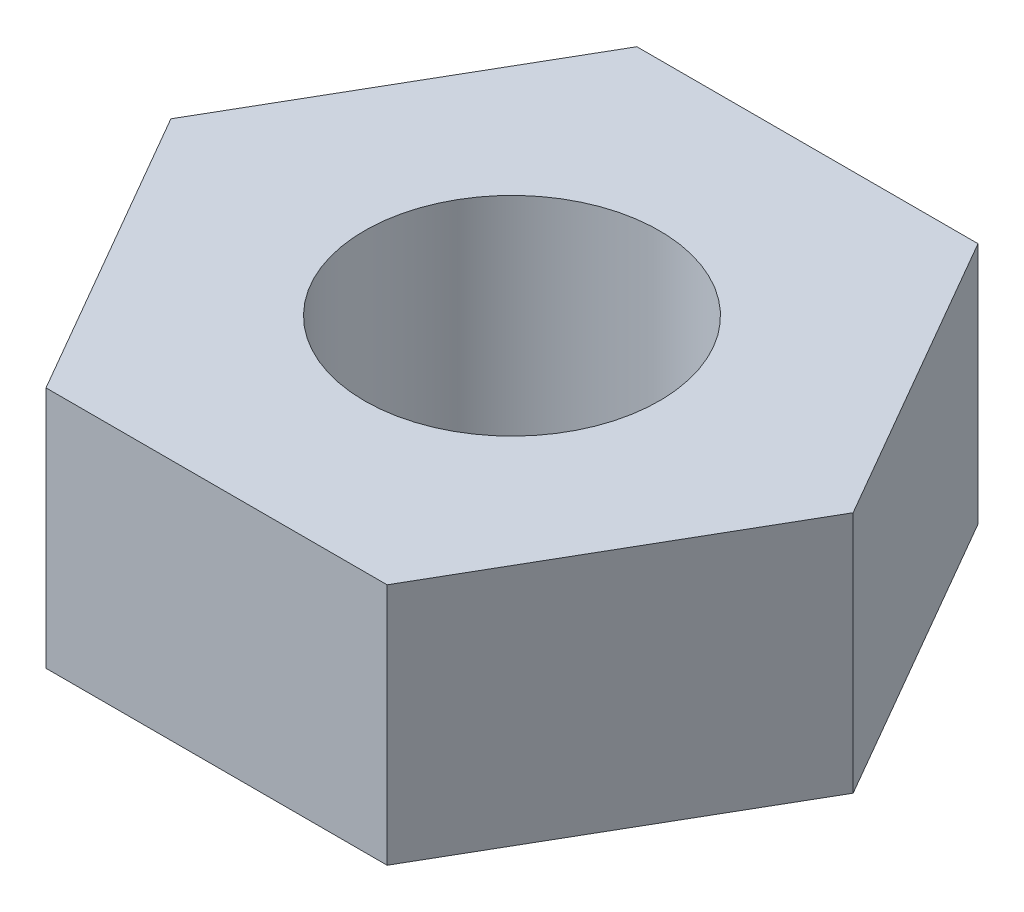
from build123d import *

# Parameters (mm, degrees)
BOSS_EXTRUDE1_DEPTH = 4.53
SKETCH2_R           = 2.75
CUT_EXTRUDE1_DEPTH  = 16.265700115


with BuildPart() as part:
    # Sketch1 → Boss-Extrude1 (new body)
    with BuildSketch(Plane(origin=(0, 0, 0), x_dir=(1, 0, 0), z_dir=(0, 1, 0))):
        Polygon((0, 0), (6.362399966, 0), (9.54359995, 5.51), (6.362399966, 11.02), (0, 11.02), (-3.181199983, 5.51), align=None)
    extrude(amount=BOSS_EXTRUDE1_DEPTH)

    # Sketch2 → Cut-Extrude1 (cut, through all)
    with BuildSketch(Plane(origin=(0, 4.53, 0), x_dir=(1, 0, 0), z_dir=(0, 1, 0))):
        with Locations(Location((3.181199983, 5.51, 0), (0, 0, 270))):
            Circle(SKETCH2_R)
    extrude(amount=-CUT_EXTRUDE1_DEPTH, mode=Mode.SUBTRACT)


solid = part.part
